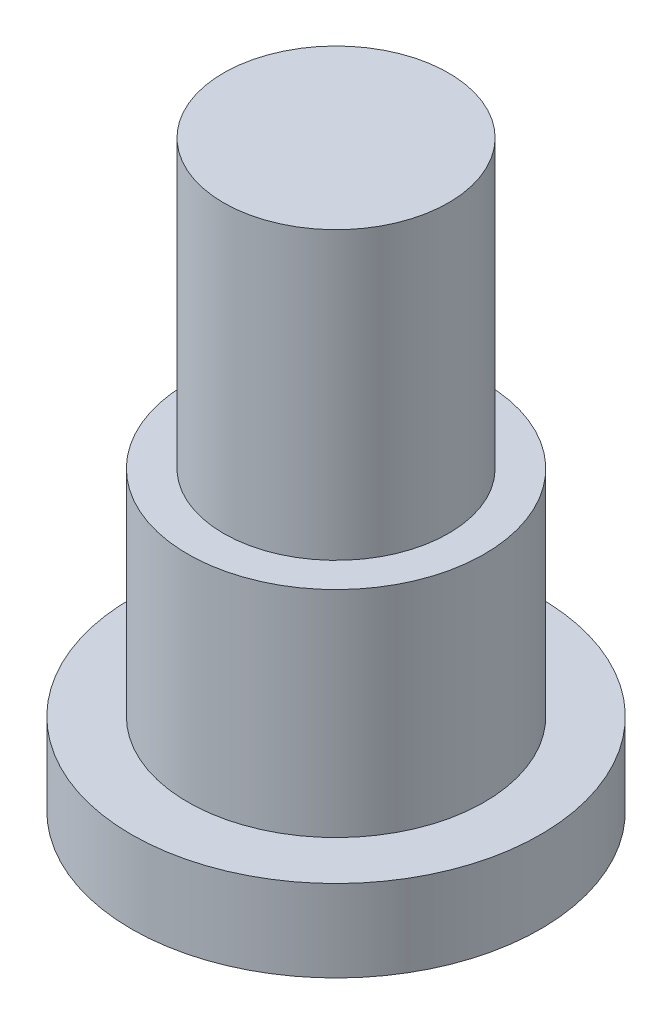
ISO-10303-21;
HEADER;
FILE_DESCRIPTION(('STEP AP214'),'2;1');
FILE_NAME('part.step','',(''),(''),'','','');
FILE_SCHEMA(('AUTOMOTIVE_DESIGN { 1 0 10303 214 1 1 1 1 }'));
ENDSEC;
DATA;
#1=APPLICATION_CONTEXT('core data for automotive mechanical design processes');
#2=APPLICATION_PROTOCOL_DEFINITION('international standard','automotive_design',2000,#1);
#3=PRODUCT_CONTEXT('',#1,'mechanical');
#4=PRODUCT('Part','Part','',(#3));
#5=PRODUCT_RELATED_PRODUCT_CATEGORY('part','',(#4));
#6=PRODUCT_DEFINITION_FORMATION('','',#4);
#7=PRODUCT_DEFINITION_CONTEXT('part definition',#1,'design');
#8=PRODUCT_DEFINITION('design','',#6,#7);
#9=PRODUCT_DEFINITION_SHAPE('','',#8);
#10=(LENGTH_UNIT() NAMED_UNIT(*) SI_UNIT(.MILLI.,.METRE.));
#11=(NAMED_UNIT(*) PLANE_ANGLE_UNIT() SI_UNIT($,.RADIAN.));
#12=(NAMED_UNIT(*) SI_UNIT($,.STERADIAN.) SOLID_ANGLE_UNIT());
#13=UNCERTAINTY_MEASURE_WITH_UNIT(LENGTH_MEASURE(1.E-05),#10,'distance_accuracy_value','');
#14=(GEOMETRIC_REPRESENTATION_CONTEXT(3) GLOBAL_UNCERTAINTY_ASSIGNED_CONTEXT((#13)) GLOBAL_UNIT_ASSIGNED_CONTEXT((#10,
#11,#12)) REPRESENTATION_CONTEXT('',''));
#15=CARTESIAN_POINT('',(0.,0.,0.));
#16=DIRECTION('',(0.,0.,1.));
#17=DIRECTION('',(1.,0.,0.));
#18=AXIS2_PLACEMENT_3D('',#15,#16,#17);
#19=CARTESIAN_POINT('',(0.,14.5,0.));
#20=DIRECTION('',(0.,1.,0.));
#21=DIRECTION('',(0.,0.,1.));
#22=AXIS2_PLACEMENT_3D('',#19,#20,#21);
#23=PLANE('',#22);
#24=CARTESIAN_POINT('',(0.,14.5,0.));
#25=DIRECTION('',(0.,1.,0.));
#26=DIRECTION('',(0.,0.,1.));
#27=AXIS2_PLACEMENT_3D('',#24,#25,#26);
#28=CIRCLE('',#27,7.25);
#29=CARTESIAN_POINT('',(0.,14.5,-7.25));
#30=VERTEX_POINT('',#29);
#31=EDGE_CURVE('E43',#30,#30,#28,.T.);
#32=ORIENTED_EDGE('',*,*,#31,.T.);
#33=EDGE_LOOP('',(#32));
#34=FACE_BOUND('',#33,.T.);
#35=CARTESIAN_POINT('',(0.,14.5,0.));
#36=DIRECTION('',(0.,1.,0.));
#37=DIRECTION('',(0.,0.,1.));
#38=AXIS2_PLACEMENT_3D('',#35,#36,#37);
#39=CIRCLE('',#38,5.5);
#40=CARTESIAN_POINT('',(0.,14.5,5.5));
#41=VERTEX_POINT('',#40);
#42=EDGE_CURVE('E51',#41,#41,#39,.T.);
#43=ORIENTED_EDGE('',*,*,#42,.F.);
#44=EDGE_LOOP('',(#43));
#45=FACE_BOUND('',#44,.T.);
#46=ADVANCED_FACE('F32',(#34,#45),#23,.T.);
#47=CARTESIAN_POINT('',(0.,4.,0.));
#48=DIRECTION('',(0.,1.,0.));
#49=DIRECTION('',(0.,0.,1.));
#50=AXIS2_PLACEMENT_3D('',#47,#48,#49);
#51=PLANE('',#50);
#52=CARTESIAN_POINT('',(0.,4.,0.));
#53=DIRECTION('',(0.,1.,0.));
#54=DIRECTION('',(0.,0.,1.));
#55=AXIS2_PLACEMENT_3D('',#52,#53,#54);
#56=CIRCLE('',#55,10.);
#57=CARTESIAN_POINT('',(0.,4.,10.));
#58=VERTEX_POINT('',#57);
#59=EDGE_CURVE('E10',#58,#58,#56,.T.);
#60=ORIENTED_EDGE('',*,*,#59,.T.);
#61=EDGE_LOOP('',(#60));
#62=FACE_BOUND('',#61,.T.);
#63=CARTESIAN_POINT('',(0.,4.,0.));
#64=DIRECTION('',(0.,1.,0.));
#65=DIRECTION('',(0.,0.,1.));
#66=AXIS2_PLACEMENT_3D('',#63,#64,#65);
#67=CIRCLE('',#66,7.25);
#68=CARTESIAN_POINT('',(0.,4.,-7.25));
#69=VERTEX_POINT('',#68);
#70=EDGE_CURVE('E45',#69,#69,#67,.T.);
#71=ORIENTED_EDGE('',*,*,#70,.F.);
#72=EDGE_LOOP('',(#71));
#73=FACE_BOUND('',#72,.T.);
#74=ADVANCED_FACE('F67',(#62,#73),#51,.T.);
#75=CARTESIAN_POINT('',(0.,4.,0.));
#76=DIRECTION('',(0.,-1.,0.));
#77=DIRECTION('',(0.,0.,-1.));
#78=AXIS2_PLACEMENT_3D('',#75,#76,#77);
#79=CYLINDRICAL_SURFACE('',#78,10.);
#80=ORIENTED_EDGE('',*,*,#59,.F.);
#81=EDGE_LOOP('',(#80));
#82=FACE_BOUND('',#81,.T.);
#83=CARTESIAN_POINT('',(0.,0.,0.));
#84=DIRECTION('',(0.,1.,0.));
#85=DIRECTION('',(0.,0.,1.));
#86=AXIS2_PLACEMENT_3D('',#83,#84,#85);
#87=CIRCLE('',#86,10.);
#88=CARTESIAN_POINT('',(0.,0.,10.));
#89=VERTEX_POINT('',#88);
#90=EDGE_CURVE('E36',#89,#89,#87,.T.);
#91=ORIENTED_EDGE('',*,*,#90,.T.);
#92=EDGE_LOOP('',(#91));
#93=FACE_BOUND('',#92,.T.);
#94=ADVANCED_FACE('F34',(#82,#93),#79,.T.);
#95=CARTESIAN_POINT('',(0.,0.,0.));
#96=DIRECTION('',(0.,1.,0.));
#97=DIRECTION('',(0.,0.,1.));
#98=AXIS2_PLACEMENT_3D('',#95,#96,#97);
#99=PLANE('',#98);
#100=ORIENTED_EDGE('',*,*,#90,.F.);
#101=EDGE_LOOP('',(#100));
#102=FACE_BOUND('',#101,.T.);
#103=ADVANCED_FACE('F77',(#102),#99,.F.);
#104=CARTESIAN_POINT('',(0.,14.5,0.));
#105=DIRECTION('',(0.,-1.,0.));
#106=DIRECTION('',(0.,0.,-1.));
#107=AXIS2_PLACEMENT_3D('',#104,#105,#106);
#108=CYLINDRICAL_SURFACE('',#107,7.25);
#109=CARTESIAN_POINT('',(0.,14.5,-7.25));
#110=CARTESIAN_POINT('',(0.,14.390625,-7.25));
#111=CARTESIAN_POINT('',(0.,14.28125,-7.25));
#112=CARTESIAN_POINT('',(0.,14.0625,-7.25));
#113=CARTESIAN_POINT('',(0.,13.953125,-7.25));
#114=CARTESIAN_POINT('',(0.,13.734375,-7.25));
#115=CARTESIAN_POINT('',(0.,13.625,-7.25));
#116=CARTESIAN_POINT('',(0.,13.40625,-7.25));
#117=CARTESIAN_POINT('',(0.,13.296875,-7.25));
#118=CARTESIAN_POINT('',(0.,13.078125,-7.25));
#119=CARTESIAN_POINT('',(0.,12.96875,-7.25));
#120=CARTESIAN_POINT('',(0.,12.75,-7.25));
#121=CARTESIAN_POINT('',(0.,12.640625,-7.25));
#122=CARTESIAN_POINT('',(0.,12.421875,-7.25));
#123=CARTESIAN_POINT('',(0.,12.3125,-7.25));
#124=CARTESIAN_POINT('',(0.,12.09375,-7.25));
#125=CARTESIAN_POINT('',(0.,11.984375,-7.25));
#126=CARTESIAN_POINT('',(0.,11.765625,-7.25));
#127=CARTESIAN_POINT('',(0.,11.65625,-7.25));
#128=CARTESIAN_POINT('',(0.,11.4375,-7.25));
#129=CARTESIAN_POINT('',(0.,11.328125,-7.25));
#130=CARTESIAN_POINT('',(0.,11.109375,-7.25));
#131=CARTESIAN_POINT('',(0.,11.,-7.25));
#132=CARTESIAN_POINT('',(0.,10.78125,-7.25));
#133=CARTESIAN_POINT('',(0.,10.671875,-7.25));
#134=CARTESIAN_POINT('',(0.,10.453125,-7.25));
#135=CARTESIAN_POINT('',(0.,10.34375,-7.25));
#136=CARTESIAN_POINT('',(0.,10.125,-7.25));
#137=CARTESIAN_POINT('',(0.,10.015625,-7.25));
#138=CARTESIAN_POINT('',(0.,9.796875,-7.25));
#139=CARTESIAN_POINT('',(0.,9.6875,-7.25));
#140=CARTESIAN_POINT('',(0.,9.46875,-7.25));
#141=CARTESIAN_POINT('',(0.,9.359375,-7.25));
#142=CARTESIAN_POINT('',(0.,9.140625,-7.25));
#143=CARTESIAN_POINT('',(0.,9.03125,-7.25));
#144=CARTESIAN_POINT('',(0.,8.8125,-7.25));
#145=CARTESIAN_POINT('',(0.,8.703125,-7.25));
#146=CARTESIAN_POINT('',(0.,8.484375,-7.25));
#147=CARTESIAN_POINT('',(0.,8.375,-7.25));
#148=CARTESIAN_POINT('',(0.,8.15625,-7.25));
#149=CARTESIAN_POINT('',(0.,8.046875,-7.25));
#150=CARTESIAN_POINT('',(0.,7.828125,-7.25));
#151=CARTESIAN_POINT('',(0.,7.71875,-7.25));
#152=CARTESIAN_POINT('',(0.,7.5,-7.25));
#153=CARTESIAN_POINT('',(0.,7.390625,-7.25));
#154=CARTESIAN_POINT('',(0.,7.171875,-7.25));
#155=CARTESIAN_POINT('',(0.,7.0625,-7.25));
#156=CARTESIAN_POINT('',(0.,6.84375,-7.25));
#157=CARTESIAN_POINT('',(0.,6.734375,-7.25));
#158=CARTESIAN_POINT('',(0.,6.515625,-7.25));
#159=CARTESIAN_POINT('',(0.,6.40625,-7.25));
#160=CARTESIAN_POINT('',(0.,6.1875,-7.25));
#161=CARTESIAN_POINT('',(0.,6.078125,-7.25));
#162=CARTESIAN_POINT('',(0.,5.859375,-7.25));
#163=CARTESIAN_POINT('',(0.,5.75,-7.25));
#164=CARTESIAN_POINT('',(0.,5.53125,-7.25));
#165=CARTESIAN_POINT('',(0.,5.421875,-7.25));
#166=CARTESIAN_POINT('',(0.,5.203125,-7.25));
#167=CARTESIAN_POINT('',(0.,5.09375,-7.25));
#168=CARTESIAN_POINT('',(0.,4.875,-7.25));
#169=CARTESIAN_POINT('',(0.,4.765625,-7.25));
#170=CARTESIAN_POINT('',(0.,4.546875,-7.25));
#171=CARTESIAN_POINT('',(0.,4.4375,-7.25));
#172=CARTESIAN_POINT('',(0.,4.21875,-7.25));
#173=CARTESIAN_POINT('',(0.,4.109375,-7.25));
#174=CARTESIAN_POINT('',(0.,4.,-7.25));
#175=B_SPLINE_CURVE_WITH_KNOTS('',3,(#109,#110,#111,#112,#113,#114,#115,#116,#117,#118,#119,
#120,#121,#122,#123,#124,#125,#126,#127,#128,#129,#130,#131,#132,#133,#134,#135,#136,#137,#138,
#139,#140,#141,#142,#143,#144,#145,#146,#147,#148,#149,#150,#151,#152,#153,#154,#155,#156,#157,
#158,#159,#160,#161,#162,#163,#164,#165,#166,#167,#168,#169,#170,#171,#172,#173,#174),
.UNSPECIFIED.,.F.,.F.,(4,2,2,2,2,2,2,2,2,2,2,2,2,2,2,2,2,2,2,2,2,2,2,2,2,2,2,2,2,2,2,2,4),(0.,
0.328125,0.656250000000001,0.984375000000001,1.3125,1.640625,1.96875,2.296875,2.625,2.953125,
3.28125,3.609375,3.9375,4.265625,4.59375,4.921875,5.25,5.578125,5.90625,6.234375,6.5625,
6.890625,7.21875,7.546875,7.875,8.203125,8.53125,8.859375,9.1875,9.515625,9.84375,10.171875,
10.5),.UNSPECIFIED.);
#176=EDGE_CURVE('BSEAM62',#30,#69,#175,.T.);
#177=ORIENTED_EDGE('',*,*,#31,.F.);
#178=ORIENTED_EDGE('',*,*,#70,.T.);
#179=ORIENTED_EDGE('',*,*,#176,.T.);
#180=ORIENTED_EDGE('',*,*,#176,.F.);
#181=EDGE_LOOP('',(#177,#179,#178,#180));
#182=FACE_BOUND('',#181,.T.);
#183=ADVANCED_FACE('F62',(#182),#108,.T.);
#184=CARTESIAN_POINT('',(0.,28.5,0.));
#185=DIRECTION('',(0.,-1.,0.));
#186=DIRECTION('',(0.,0.,-1.));
#187=AXIS2_PLACEMENT_3D('',#184,#185,#186);
#188=CYLINDRICAL_SURFACE('',#187,5.5);
#189=CARTESIAN_POINT('',(0.,28.5,0.));
#190=DIRECTION('',(0.,1.,0.));
#191=DIRECTION('',(0.,0.,1.));
#192=AXIS2_PLACEMENT_3D('',#189,#190,#191);
#193=CIRCLE('',#192,5.5);
#194=CARTESIAN_POINT('',(0.,28.5,5.5));
#195=VERTEX_POINT('',#194);
#196=EDGE_CURVE('E48',#195,#195,#193,.T.);
#197=ORIENTED_EDGE('',*,*,#196,.F.);
#198=EDGE_LOOP('',(#197));
#199=FACE_BOUND('',#198,.T.);
#200=ORIENTED_EDGE('',*,*,#42,.T.);
#201=EDGE_LOOP('',(#200));
#202=FACE_BOUND('',#201,.T.);
#203=ADVANCED_FACE('F59',(#199,#202),#188,.T.);
#204=CARTESIAN_POINT('',(0.,28.5,0.));
#205=DIRECTION('',(0.,1.,0.));
#206=DIRECTION('',(0.,0.,1.));
#207=AXIS2_PLACEMENT_3D('',#204,#205,#206);
#208=PLANE('',#207);
#209=ORIENTED_EDGE('',*,*,#196,.T.);
#210=EDGE_LOOP('',(#209));
#211=FACE_BOUND('',#210,.T.);
#212=ADVANCED_FACE('F57',(#211),#208,.T.);
#213=CLOSED_SHELL('',(#46,#74,#94,#103,#183,#203,#212));
#214=MANIFOLD_SOLID_BREP('B2',#213);
#215=ADVANCED_BREP_SHAPE_REPRESENTATION('',(#18,#214),#14);
#216=SHAPE_DEFINITION_REPRESENTATION(#9,#215);
ENDSEC;
END-ISO-10303-21;
